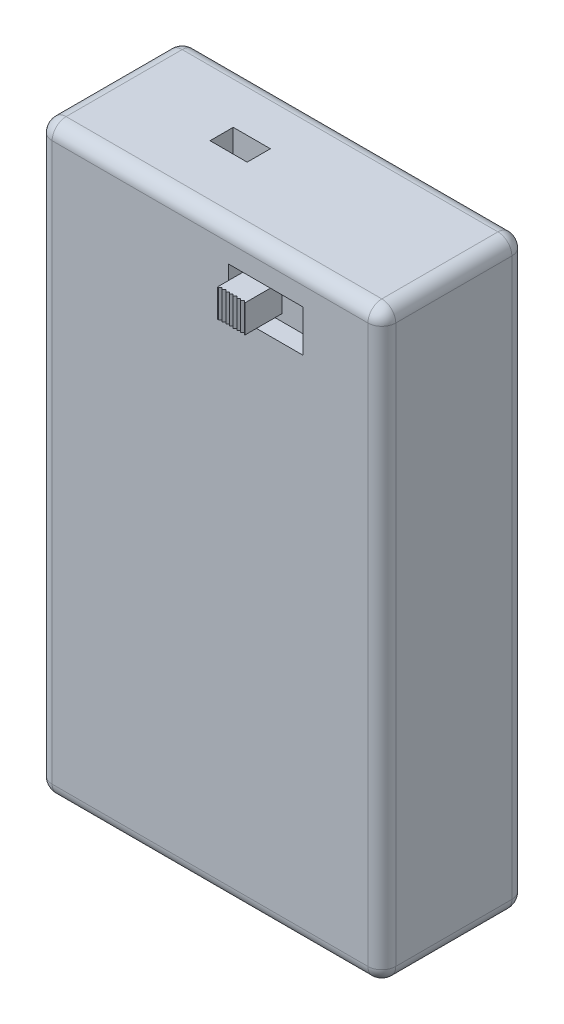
from build123d import *

# Parameters (mm, degrees)
ESQUISSE1_W                  = 37
ESQUISSE1_H                  = 63
BOSS_EXTRU_1_DEPTH           = 15.5
CONG_1_R                     = 1.5
ESQUISSE2_W                  = 8
ESQUISSE2_H                  = 4.5
ENL_V_MAT_EXTRU_1_DEPTH      = 2
ESQUISSE3_W                  = 2.965360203
ESQUISSE3_H                  = 3
BOSS_EXTRU_2_DEPTH           = 4
ENL_V_MAT_EXTRU_2_DEPTH      = 72.601763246
ENL_V_MAT_EXTRU_2_DEPTH_BACK = 4
ESQUISSE5_W                  = 4
ESQUISSE5_H                  = 2.5
ENL_V_MAT_EXTRU_3_DEPTH      = 4


with BuildPart() as part:
    # Esquisse1 → Boss.-Extru.1 (new body)
    with BuildSketch(Plane.XY):
        with Locations((18.5, 31.5)):
            Rectangle(ESQUISSE1_W, ESQUISSE1_H)
    extrude(amount=BOSS_EXTRU_1_DEPTH)

    # Cong_1
    cong_1_edges = [part.edges().sort_by_distance(p)[0] for p in [
        (37, 31.5, 15.5),
        (18.5, 63, 15.5),
        (0, 31.5, 15.5),
        (18.5, 63, 0),
        (37, 31.5, 0),
        (18.5, 0, 0),
        (0, 31.5, 0),
        (18.5, 0, 15.5),
        (0, 63, 7.75),
        (37, 63, 7.75),
        (37, 0, 7.75),
        (0, 0, 7.75),
    ]]
    fillet(cong_1_edges, radius=CONG_1_R)

    # Esquisse2 → Enl_v. mat.-Extru.1 (cut)
    with BuildSketch(Plane.XY.offset(15.5)):
        with Locations((24.5, 57.25)):
            Rectangle(ESQUISSE2_W, ESQUISSE2_H)
    extrude(amount=-ENL_V_MAT_EXTRU_1_DEPTH, mode=Mode.SUBTRACT)

    # Esquisse3 → Boss.-Extru.2 (add)
    with BuildSketch(Plane.XY.offset(13.5)):
        with Locations((22.767319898, 57.25)):
            Rectangle(ESQUISSE3_W, ESQUISSE3_H)
    extrude(amount=BOSS_EXTRU_2_DEPTH)

    # Esquisse4 → Enl_v. mat.-Extru.2 (cut, two sides: drawn at the far end of the back side and taken through both)
    with BuildSketch(Plane(origin=(0, 58.75, 0), x_dir=(1, 0, 0), z_dir=(0, 1, 0)).offset(-ENL_V_MAT_EXTRU_2_DEPTH_BACK)):
        Polygon((21.39599032, -17.5), (21.59599032, -17.3), (21.79599032, -17.5), (21.99599032, -17.3), (22.19599032, -17.5), (22.39599032, -17.3), (22.59599032, -17.5), (22.79599032, -17.3), (22.99599032, -17.5), (23.19599032, -17.3), (23.39599032, -17.5), (23.59599032, -17.3), (23.79599032, -17.5), (23.99599032, -17.3), (24.19599032, -17.5), (24.19599032, -17.829439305), (21.39599032, -17.829439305), align=None)
    extrude(amount=ENL_V_MAT_EXTRU_2_DEPTH + ENL_V_MAT_EXTRU_2_DEPTH_BACK, mode=Mode.SUBTRACT)

    # Esquisse5 → Enl_v. mat.-Extru.3 (cut)
    with BuildSketch(Plane(origin=(0, 63, 0), x_dir=(1, 0, 0), z_dir=(0, 1, 0))):
        with Locations((13.5, -7.25)):
            Rectangle(ESQUISSE5_W, ESQUISSE5_H)
    extrude(amount=-ENL_V_MAT_EXTRU_3_DEPTH, mode=Mode.SUBTRACT)


solid = part.part
